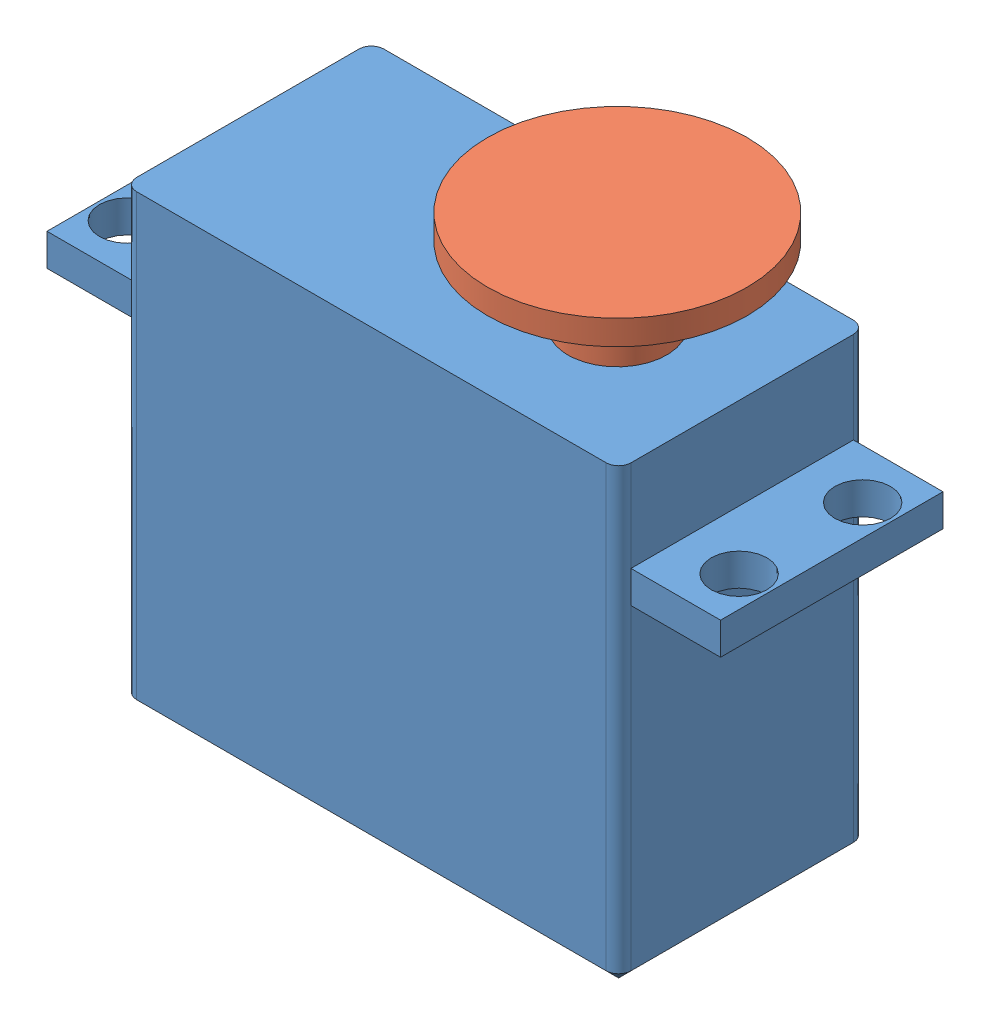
SolidWorks assembly Futaba_Servo_ASM.SLDASM, configuration Default (file format 7000). Lengths in mm.
Overall size (54.5 44.6 21).
2 component instances, 2 part files, 2 mates.
Components (placement in the parent):
- Futaba_Servo-2: Futaba_Servo.SLDPRT [Default] at origin size (54.5 36.6 20)
- Futaba_Servo_Flange-1: Futaba_Servo_Flange.SLDPRT [Default] at (9.9 36.6 0) size (21 8 21)
Mates (geometry in assembly coordinates):
- Coincident1: coincident anti-aligned: line of Futaba_Servo-2 through (9.9 36.6 0) axis (0 1 0); line of Futaba_Servo_Flange-1 through (9.9 42.6 0) axis (0 -1 0)
- Coincident2: coincident anti-aligned: plane of Futaba_Servo-2 through (0 36.6 0) normal (0 1 0); plane of Futaba_Servo_Flange-1 through (9.9 36.6 0) normal (0 -1 0)
